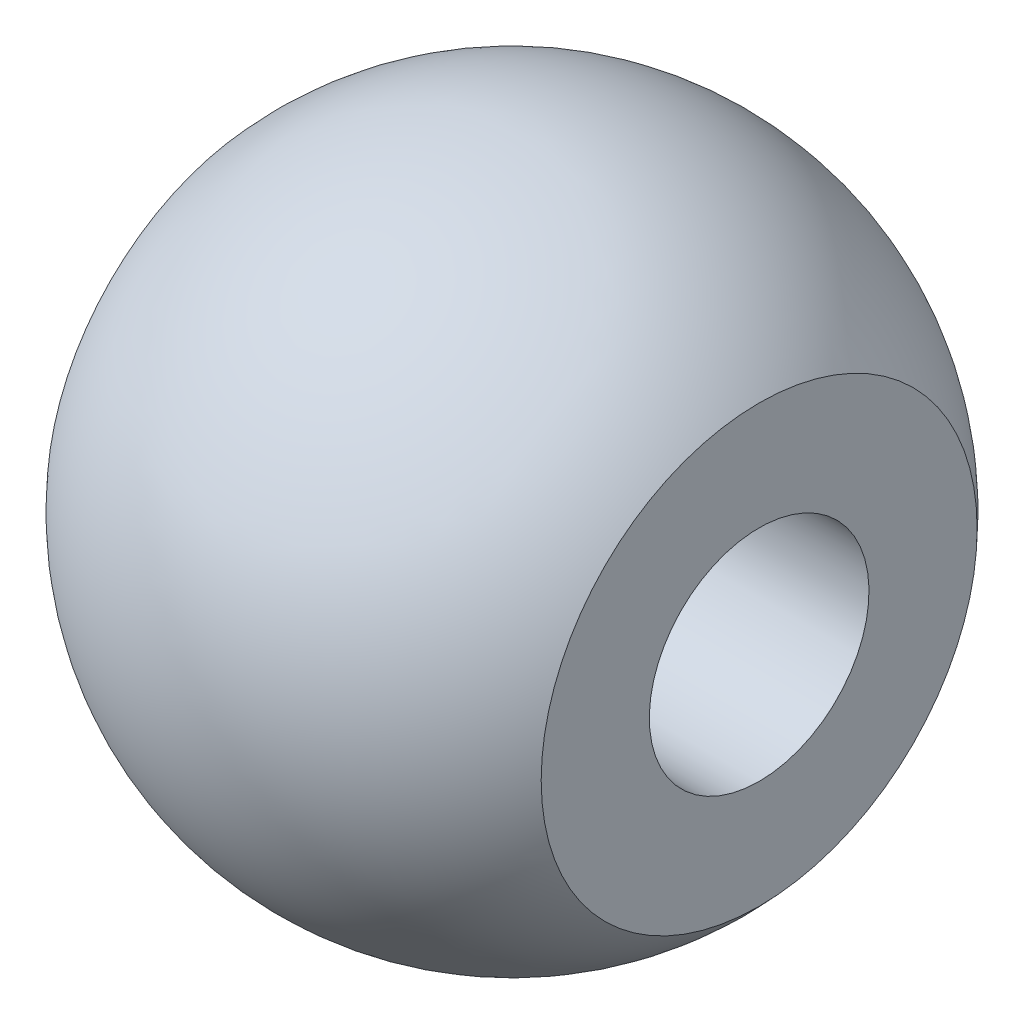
from build123d import *


with BuildPart() as part:
    # Sketch1 → Revolve1 (revolve)
    with BuildSketch(Plane.XY, mode=Mode.PRIVATE) as revolve1_sk:
        with BuildLine():
            Line((-4.5, 3.968626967), (-3.5, 2))
            Line((-3.5, 2), (4.5, 2))
            Line((4.5, 2), (4.5, 3.968626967))
            ThreePointArc((4.5, 3.968626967), (0, 6), (-4.5, 3.968626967))
        make_face()
    revolve(revolve1_sk.sketch.rotate(Axis((-4.5, 0, 0), (1, 0, 0)), 180), axis=Axis((-4.5, 0, 0), (1, 0, 0)))


solid = part.part
